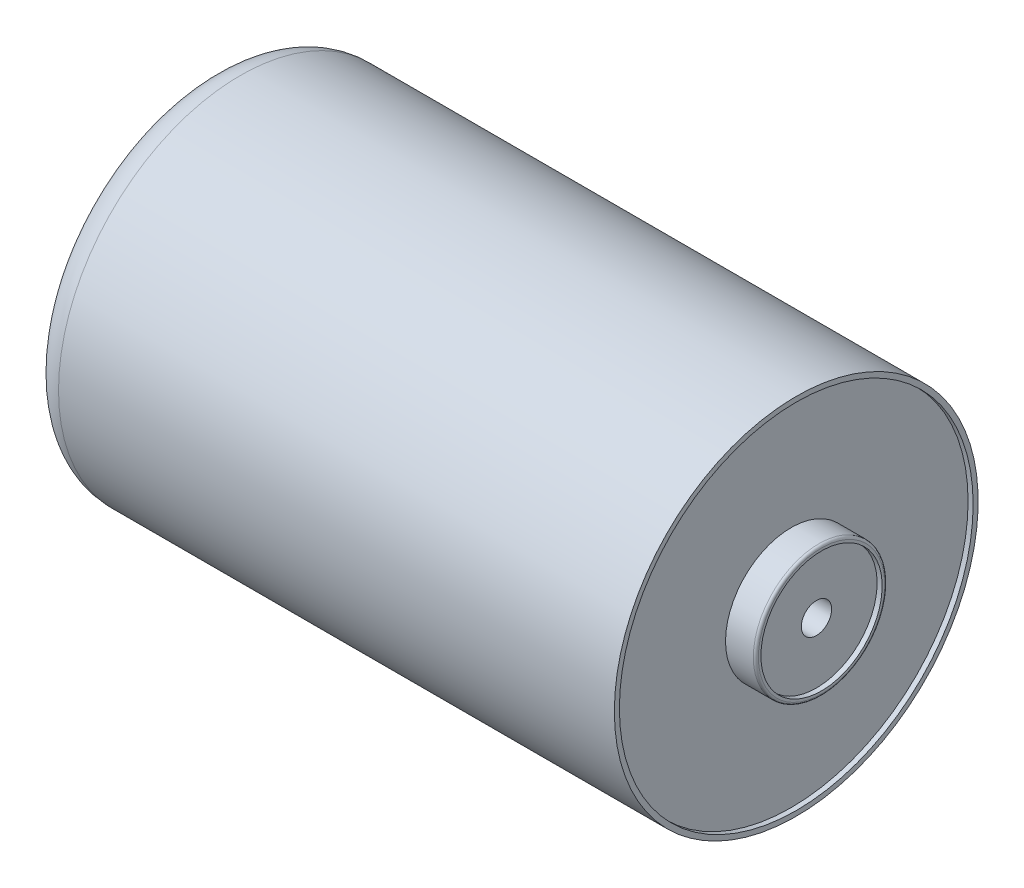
ISO-10303-21;
HEADER;
FILE_DESCRIPTION(('STEP AP214'),'2;1');
FILE_NAME('part.step','',(''),(''),'','','');
FILE_SCHEMA(('AUTOMOTIVE_DESIGN { 1 0 10303 214 1 1 1 1 }'));
ENDSEC;
DATA;
#1=APPLICATION_CONTEXT('core data for automotive mechanical design processes');
#2=APPLICATION_PROTOCOL_DEFINITION('international standard','automotive_design',2000,#1);
#3=PRODUCT_CONTEXT('',#1,'mechanical');
#4=PRODUCT('Part','Part','',(#3));
#5=PRODUCT_RELATED_PRODUCT_CATEGORY('part','',(#4));
#6=PRODUCT_DEFINITION_FORMATION('','',#4);
#7=PRODUCT_DEFINITION_CONTEXT('part definition',#1,'design');
#8=PRODUCT_DEFINITION('design','',#6,#7);
#9=PRODUCT_DEFINITION_SHAPE('','',#8);
#10=(LENGTH_UNIT() NAMED_UNIT(*) SI_UNIT(.MILLI.,.METRE.));
#11=(NAMED_UNIT(*) PLANE_ANGLE_UNIT() SI_UNIT($,.RADIAN.));
#12=(NAMED_UNIT(*) SI_UNIT($,.STERADIAN.) SOLID_ANGLE_UNIT());
#13=UNCERTAINTY_MEASURE_WITH_UNIT(LENGTH_MEASURE(1.E-05),#10,'distance_accuracy_value','');
#14=(GEOMETRIC_REPRESENTATION_CONTEXT(3) GLOBAL_UNCERTAINTY_ASSIGNED_CONTEXT((#13)) GLOBAL_UNIT_ASSIGNED_CONTEXT((#10,
#11,#12)) REPRESENTATION_CONTEXT('',''));
#15=CARTESIAN_POINT('',(0.,0.,0.));
#16=DIRECTION('',(0.,0.,1.));
#17=DIRECTION('',(1.,0.,0.));
#18=AXIS2_PLACEMENT_3D('',#15,#16,#17);
#19=CARTESIAN_POINT('',(0.,0.,0.));
#20=DIRECTION('',(-1.,0.,0.));
#21=DIRECTION('',(0.,0.,1.));
#22=AXIS2_PLACEMENT_3D('',#19,#20,#21);
#23=CYLINDRICAL_SURFACE('',#22,1.49999999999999);
#24=CARTESIAN_POINT('',(70.4735008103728,0.,0.));
#25=DIRECTION('',(-1.,0.,0.));
#26=DIRECTION('',(0.,0.,1.));
#27=AXIS2_PLACEMENT_3D('',#24,#25,#26);
#28=CIRCLE('',#27,1.5);
#29=CARTESIAN_POINT('',(70.4735008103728,0.,1.5));
#30=VERTEX_POINT('',#29);
#31=EDGE_CURVE('E91',#30,#30,#28,.T.);
#32=ORIENTED_EDGE('',*,*,#31,.F.);
#33=EDGE_LOOP('',(#32));
#34=FACE_BOUND('',#33,.T.);
#35=CARTESIAN_POINT('',(6.47350081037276,0.,0.));
#36=DIRECTION('',(-1.,0.,0.));
#37=DIRECTION('',(0.,0.,1.));
#38=AXIS2_PLACEMENT_3D('',#35,#36,#37);
#39=CIRCLE('',#38,1.49999999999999);
#40=CARTESIAN_POINT('',(6.47350081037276,0.,1.49999999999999));
#41=VERTEX_POINT('',#40);
#42=EDGE_CURVE('E64',#41,#41,#39,.T.);
#43=ORIENTED_EDGE('',*,*,#42,.T.);
#44=EDGE_LOOP('',(#43));
#45=FACE_BOUND('',#44,.T.);
#46=ADVANCED_FACE('F33',(#34,#45),#23,.F.);
#47=CARTESIAN_POINT('',(6.47350081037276,1.49999999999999,0.));
#48=DIRECTION('',(1.,0.,0.));
#49=DIRECTION('',(0.,0.,-1.));
#50=AXIS2_PLACEMENT_3D('',#47,#48,#49);
#51=PLANE('',#50);
#52=ORIENTED_EDGE('',*,*,#42,.F.);
#53=EDGE_LOOP('',(#52));
#54=FACE_BOUND('',#53,.T.);
#55=CARTESIAN_POINT('',(6.47350081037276,0.,0.));
#56=DIRECTION('',(-1.,0.,0.));
#57=DIRECTION('',(0.,0.,1.));
#58=AXIS2_PLACEMENT_3D('',#55,#56,#57);
#59=CIRCLE('',#58,6.);
#60=CARTESIAN_POINT('',(6.47350081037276,0.,6.));
#61=VERTEX_POINT('',#60);
#62=EDGE_CURVE('E67',#61,#61,#59,.T.);
#63=ORIENTED_EDGE('',*,*,#62,.T.);
#64=EDGE_LOOP('',(#63));
#65=FACE_BOUND('',#64,.T.);
#66=ADVANCED_FACE('F146',(#54,#65),#51,.F.);
#67=CARTESIAN_POINT('',(0.,0.,0.));
#68=DIRECTION('',(-1.,0.,0.));
#69=DIRECTION('',(0.,0.,1.));
#70=AXIS2_PLACEMENT_3D('',#67,#68,#69);
#71=CYLINDRICAL_SURFACE('',#70,6.);
#72=ORIENTED_EDGE('',*,*,#62,.F.);
#73=EDGE_LOOP('',(#72));
#74=FACE_BOUND('',#73,.T.);
#75=CARTESIAN_POINT('',(5.97350081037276,0.,0.));
#76=DIRECTION('',(-1.,0.,0.));
#77=DIRECTION('',(0.,0.,1.));
#78=AXIS2_PLACEMENT_3D('',#75,#76,#77);
#79=CIRCLE('',#78,6.);
#80=CARTESIAN_POINT('',(5.97350081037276,0.,6.));
#81=VERTEX_POINT('',#80);
#82=EDGE_CURVE('E70',#81,#81,#79,.T.);
#83=ORIENTED_EDGE('',*,*,#82,.T.);
#84=EDGE_LOOP('',(#83));
#85=FACE_BOUND('',#84,.T.);
#86=ADVANCED_FACE('F141',(#74,#85),#71,.F.);
#87=CARTESIAN_POINT('',(5.97350081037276,6.,0.));
#88=DIRECTION('',(1.,0.,0.));
#89=DIRECTION('',(0.,0.,-1.));
#90=AXIS2_PLACEMENT_3D('',#87,#88,#89);
#91=PLANE('',#90);
#92=CARTESIAN_POINT('',(5.97350081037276,0.,0.));
#93=DIRECTION('',(1.,0.,0.));
#94=DIRECTION('',(0.,0.,-1.));
#95=AXIS2_PLACEMENT_3D('',#92,#93,#94);
#96=CIRCLE('',#95,6.25);
#97=CARTESIAN_POINT('',(5.97350081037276,0.,-6.25));
#98=VERTEX_POINT('',#97);
#99=EDGE_CURVE('E43',#98,#98,#96,.F.);
#100=ORIENTED_EDGE('',*,*,#99,.T.);
#101=EDGE_LOOP('',(#100));
#102=FACE_BOUND('',#101,.T.);
#103=ORIENTED_EDGE('',*,*,#82,.F.);
#104=EDGE_LOOP('',(#103));
#105=FACE_BOUND('',#104,.T.);
#106=ADVANCED_FACE('F129',(#102,#105),#91,.F.);
#107=CARTESIAN_POINT('',(0.,0.,0.));
#108=DIRECTION('',(-1.,0.,0.));
#109=DIRECTION('',(0.,0.,1.));
#110=AXIS2_PLACEMENT_3D('',#107,#108,#109);
#111=CYLINDRICAL_SURFACE('',#110,6.5);
#112=CARTESIAN_POINT('',(10.2235008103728,0.,0.));
#113=DIRECTION('',(1.,0.,0.));
#114=DIRECTION('',(0.,0.,-1.));
#115=AXIS2_PLACEMENT_3D('',#112,#113,#114);
#116=CIRCLE('',#115,6.5);
#117=CARTESIAN_POINT('',(10.2235008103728,0.,-6.5));
#118=VERTEX_POINT('',#117);
#119=EDGE_CURVE('E52',#118,#118,#116,.F.);
#120=ORIENTED_EDGE('',*,*,#119,.T.);
#121=EDGE_LOOP('',(#120));
#122=FACE_BOUND('',#121,.T.);
#123=CARTESIAN_POINT('',(6.22350081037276,0.,0.));
#124=DIRECTION('',(1.,0.,0.));
#125=DIRECTION('',(0.,0.,-1.));
#126=AXIS2_PLACEMENT_3D('',#123,#124,#125);
#127=CIRCLE('',#126,6.5);
#128=CARTESIAN_POINT('',(6.22350081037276,0.,-6.5));
#129=VERTEX_POINT('',#128);
#130=EDGE_CURVE('E55',#129,#129,#127,.T.);
#131=ORIENTED_EDGE('',*,*,#130,.T.);
#132=EDGE_LOOP('',(#131));
#133=FACE_BOUND('',#132,.T.);
#134=ADVANCED_FACE('F113',(#122,#133),#111,.T.);
#135=CARTESIAN_POINT('',(10.4735008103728,6.5,0.));
#136=DIRECTION('',(1.,0.,0.));
#137=DIRECTION('',(0.,0.,-1.));
#138=AXIS2_PLACEMENT_3D('',#135,#136,#137);
#139=PLANE('',#138);
#140=CARTESIAN_POINT('',(10.4735008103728,0.,-12.5));
#141=DIRECTION('',(-1.,0.,0.));
#142=DIRECTION('',(0.,0.,-1.));
#143=AXIS2_PLACEMENT_3D('',#140,#141,#142);
#144=CIRCLE('',#143,1.);
#145=CARTESIAN_POINT('',(10.4735008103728,0.,-13.5));
#146=VERTEX_POINT('',#145);
#147=EDGE_CURVE('E103',#146,#146,#144,.T.);
#148=ORIENTED_EDGE('',*,*,#147,.F.);
#149=EDGE_LOOP('',(#148));
#150=FACE_BOUND('',#149,.T.);
#151=CARTESIAN_POINT('',(10.4735008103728,0.,12.5));
#152=DIRECTION('',(-1.,0.,0.));
#153=DIRECTION('',(0.,0.,1.));
#154=AXIS2_PLACEMENT_3D('',#151,#152,#153);
#155=CIRCLE('',#154,1.);
#156=CARTESIAN_POINT('',(10.4735008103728,0.,13.5));
#157=VERTEX_POINT('',#156);
#158=EDGE_CURVE('E97',#157,#157,#155,.T.);
#159=ORIENTED_EDGE('',*,*,#158,.F.);
#160=EDGE_LOOP('',(#159));
#161=FACE_BOUND('',#160,.T.);
#162=CARTESIAN_POINT('',(10.4735008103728,0.,0.));
#163=DIRECTION('',(1.,0.,0.));
#164=DIRECTION('',(0.,0.,-1.));
#165=AXIS2_PLACEMENT_3D('',#162,#163,#164);
#166=CIRCLE('',#165,15.);
#167=CARTESIAN_POINT('',(10.4735008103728,0.,-15.));
#168=VERTEX_POINT('',#167);
#169=EDGE_CURVE('E39',#168,#168,#166,.F.);
#170=ORIENTED_EDGE('',*,*,#169,.T.);
#171=EDGE_LOOP('',(#170));
#172=FACE_BOUND('',#171,.T.);
#173=CARTESIAN_POINT('',(10.4735008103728,0.,0.));
#174=DIRECTION('',(1.,0.,0.));
#175=DIRECTION('',(0.,0.,-1.));
#176=AXIS2_PLACEMENT_3D('',#173,#174,#175);
#177=CIRCLE('',#176,6.75);
#178=CARTESIAN_POINT('',(10.4735008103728,0.,-6.75));
#179=VERTEX_POINT('',#178);
#180=EDGE_CURVE('E47',#179,#179,#177,.T.);
#181=ORIENTED_EDGE('',*,*,#180,.T.);
#182=EDGE_LOOP('',(#181));
#183=FACE_BOUND('',#182,.T.);
#184=ADVANCED_FACE('F109',(#150,#161,#172,#183),#139,.F.);
#185=CARTESIAN_POINT('',(0.,0.,0.));
#186=DIRECTION('',(-1.,0.,0.));
#187=DIRECTION('',(0.,0.,1.));
#188=AXIS2_PLACEMENT_3D('',#185,#186,#187);
#189=CYLINDRICAL_SURFACE('',#188,18.);
#190=CARTESIAN_POINT('',(13.4735008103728,0.,0.));
#191=DIRECTION('',(1.,0.,0.));
#192=DIRECTION('',(0.,0.,-1.));
#193=AXIS2_PLACEMENT_3D('',#190,#191,#192);
#194=CIRCLE('',#193,18.);
#195=CARTESIAN_POINT('',(13.4735008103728,0.,-18.));
#196=VERTEX_POINT('',#195);
#197=EDGE_CURVE('E10',#196,#196,#194,.T.);
#198=ORIENTED_EDGE('',*,*,#197,.T.);
#199=EDGE_LOOP('',(#198));
#200=FACE_BOUND('',#199,.T.);
#201=CARTESIAN_POINT('',(68.4735008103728,0.,0.));
#202=DIRECTION('',(-1.,0.,0.));
#203=DIRECTION('',(0.,0.,1.));
#204=AXIS2_PLACEMENT_3D('',#201,#202,#203);
#205=CIRCLE('',#204,18.);
#206=CARTESIAN_POINT('',(68.4735008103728,0.,18.));
#207=VERTEX_POINT('',#206);
#208=EDGE_CURVE('E73',#207,#207,#205,.T.);
#209=ORIENTED_EDGE('',*,*,#208,.T.);
#210=EDGE_LOOP('',(#209));
#211=FACE_BOUND('',#210,.T.);
#212=ADVANCED_FACE('F112',(#200,#211),#189,.T.);
#213=CARTESIAN_POINT('',(68.4735008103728,18.,0.));
#214=DIRECTION('',(-1.,0.,0.));
#215=DIRECTION('',(0.,0.,1.));
#216=AXIS2_PLACEMENT_3D('',#213,#214,#215);
#217=PLANE('',#216);
#218=ORIENTED_EDGE('',*,*,#208,.F.);
#219=EDGE_LOOP('',(#218));
#220=FACE_BOUND('',#219,.T.);
#221=CARTESIAN_POINT('',(68.4735008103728,0.,0.));
#222=DIRECTION('',(-1.,0.,0.));
#223=DIRECTION('',(0.,0.,1.));
#224=AXIS2_PLACEMENT_3D('',#221,#222,#223);
#225=CIRCLE('',#224,17.5029717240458);
#226=CARTESIAN_POINT('',(68.4735008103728,0.,17.5029717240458));
#227=VERTEX_POINT('',#226);
#228=EDGE_CURVE('E76',#227,#227,#225,.T.);
#229=ORIENTED_EDGE('',*,*,#228,.T.);
#230=EDGE_LOOP('',(#229));
#231=FACE_BOUND('',#230,.T.);
#232=ADVANCED_FACE('F193',(#220,#231),#217,.F.);
#233=CARTESIAN_POINT('',(0.,0.,0.));
#234=DIRECTION('',(-1.,0.,0.));
#235=DIRECTION('',(0.,0.,1.));
#236=AXIS2_PLACEMENT_3D('',#233,#234,#235);
#237=CYLINDRICAL_SURFACE('',#236,17.5029717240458);
#238=ORIENTED_EDGE('',*,*,#228,.F.);
#239=EDGE_LOOP('',(#238));
#240=FACE_BOUND('',#239,.T.);
#241=CARTESIAN_POINT('',(67.9735008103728,0.,0.));
#242=DIRECTION('',(-1.,0.,0.));
#243=DIRECTION('',(0.,0.,1.));
#244=AXIS2_PLACEMENT_3D('',#241,#242,#243);
#245=CIRCLE('',#244,17.5029717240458);
#246=CARTESIAN_POINT('',(67.9735008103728,0.,17.5029717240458));
#247=VERTEX_POINT('',#246);
#248=EDGE_CURVE('E79',#247,#247,#245,.T.);
#249=ORIENTED_EDGE('',*,*,#248,.T.);
#250=EDGE_LOOP('',(#249));
#251=FACE_BOUND('',#250,.T.);
#252=ADVANCED_FACE('F189',(#240,#251),#237,.F.);
#253=CARTESIAN_POINT('',(67.9735008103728,17.5029717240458,0.));
#254=DIRECTION('',(-1.,0.,0.));
#255=DIRECTION('',(0.,0.,1.));
#256=AXIS2_PLACEMENT_3D('',#253,#254,#255);
#257=PLANE('',#256);
#258=ORIENTED_EDGE('',*,*,#248,.F.);
#259=EDGE_LOOP('',(#258));
#260=FACE_BOUND('',#259,.T.);
#261=CARTESIAN_POINT('',(67.9735008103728,0.,0.));
#262=DIRECTION('',(-1.,0.,0.));
#263=DIRECTION('',(0.,0.,1.));
#264=AXIS2_PLACEMENT_3D('',#261,#262,#263);
#265=CIRCLE('',#264,6.5);
#266=CARTESIAN_POINT('',(67.9735008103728,0.,6.5));
#267=VERTEX_POINT('',#266);
#268=EDGE_CURVE('E82',#267,#267,#265,.T.);
#269=ORIENTED_EDGE('',*,*,#268,.T.);
#270=EDGE_LOOP('',(#269));
#271=FACE_BOUND('',#270,.T.);
#272=ADVANCED_FACE('F185',(#260,#271),#257,.F.);
#273=CARTESIAN_POINT('',(0.,0.,0.));
#274=DIRECTION('',(-1.,0.,0.));
#275=DIRECTION('',(0.,0.,1.));
#276=AXIS2_PLACEMENT_3D('',#273,#274,#275);
#277=CYLINDRICAL_SURFACE('',#276,6.5);
#278=CARTESIAN_POINT('',(70.7235008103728,0.,0.));
#279=DIRECTION('',(-1.,0.,0.));
#280=DIRECTION('',(0.,0.,1.));
#281=AXIS2_PLACEMENT_3D('',#278,#279,#280);
#282=CIRCLE('',#281,6.5);
#283=CARTESIAN_POINT('',(70.7235008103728,0.,6.5));
#284=VERTEX_POINT('',#283);
#285=EDGE_CURVE('E61',#284,#284,#282,.T.);
#286=ORIENTED_EDGE('',*,*,#285,.T.);
#287=EDGE_LOOP('',(#286));
#288=FACE_BOUND('',#287,.T.);
#289=ORIENTED_EDGE('',*,*,#268,.F.);
#290=EDGE_LOOP('',(#289));
#291=FACE_BOUND('',#290,.T.);
#292=ADVANCED_FACE('F181',(#288,#291),#277,.T.);
#293=CARTESIAN_POINT('',(70.9735008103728,6.5,0.));
#294=DIRECTION('',(-1.,0.,0.));
#295=DIRECTION('',(0.,0.,1.));
#296=AXIS2_PLACEMENT_3D('',#293,#294,#295);
#297=PLANE('',#296);
#298=CARTESIAN_POINT('',(70.9735008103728,0.,0.));
#299=DIRECTION('',(-1.,0.,0.));
#300=DIRECTION('',(0.,0.,1.));
#301=AXIS2_PLACEMENT_3D('',#298,#299,#300);
#302=CIRCLE('',#301,6.25);
#303=CARTESIAN_POINT('',(70.9735008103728,0.,6.25));
#304=VERTEX_POINT('',#303);
#305=EDGE_CURVE('E58',#304,#304,#302,.F.);
#306=ORIENTED_EDGE('',*,*,#305,.T.);
#307=EDGE_LOOP('',(#306));
#308=FACE_BOUND('',#307,.T.);
#309=CARTESIAN_POINT('',(70.9735008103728,0.,0.));
#310=DIRECTION('',(-1.,0.,0.));
#311=DIRECTION('',(0.,0.,1.));
#312=AXIS2_PLACEMENT_3D('',#309,#310,#311);
#313=CIRCLE('',#312,6.);
#314=CARTESIAN_POINT('',(70.9735008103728,0.,6.));
#315=VERTEX_POINT('',#314);
#316=EDGE_CURVE('E85',#315,#315,#313,.T.);
#317=ORIENTED_EDGE('',*,*,#316,.T.);
#318=EDGE_LOOP('',(#317));
#319=FACE_BOUND('',#318,.T.);
#320=ADVANCED_FACE('F174',(#308,#319),#297,.F.);
#321=CARTESIAN_POINT('',(0.,0.,0.));
#322=DIRECTION('',(-1.,0.,0.));
#323=DIRECTION('',(0.,0.,1.));
#324=AXIS2_PLACEMENT_3D('',#321,#322,#323);
#325=CYLINDRICAL_SURFACE('',#324,6.);
#326=ORIENTED_EDGE('',*,*,#316,.F.);
#327=EDGE_LOOP('',(#326));
#328=FACE_BOUND('',#327,.T.);
#329=CARTESIAN_POINT('',(70.4735008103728,0.,0.));
#330=DIRECTION('',(-1.,0.,0.));
#331=DIRECTION('',(0.,0.,1.));
#332=AXIS2_PLACEMENT_3D('',#329,#330,#331);
#333=CIRCLE('',#332,6.);
#334=CARTESIAN_POINT('',(70.4735008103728,0.,6.));
#335=VERTEX_POINT('',#334);
#336=EDGE_CURVE('E88',#335,#335,#333,.T.);
#337=ORIENTED_EDGE('',*,*,#336,.T.);
#338=EDGE_LOOP('',(#337));
#339=FACE_BOUND('',#338,.T.);
#340=ADVANCED_FACE('F165',(#328,#339),#325,.F.);
#341=CARTESIAN_POINT('',(70.4735008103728,6.,0.));
#342=DIRECTION('',(-1.,0.,0.));
#343=DIRECTION('',(0.,0.,1.));
#344=AXIS2_PLACEMENT_3D('',#341,#342,#343);
#345=PLANE('',#344);
#346=ORIENTED_EDGE('',*,*,#336,.F.);
#347=EDGE_LOOP('',(#346));
#348=FACE_BOUND('',#347,.T.);
#349=ORIENTED_EDGE('',*,*,#31,.T.);
#350=EDGE_LOOP('',(#349));
#351=FACE_BOUND('',#350,.T.);
#352=ADVANCED_FACE('F163',(#348,#351),#345,.F.);
#353=CARTESIAN_POINT('',(70.7235008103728,0.,0.));
#354=DIRECTION('',(-1.,0.,0.));
#355=DIRECTION('',(0.,0.,1.));
#356=AXIS2_PLACEMENT_3D('',#353,#354,#355);
#357=TOROIDAL_SURFACE('',#356,6.25,0.25);
#358=ORIENTED_EDGE('',*,*,#305,.F.);
#359=EDGE_LOOP('',(#358));
#360=FACE_BOUND('',#359,.T.);
#361=ORIENTED_EDGE('',*,*,#285,.F.);
#362=EDGE_LOOP('',(#361));
#363=FACE_BOUND('',#362,.T.);
#364=ADVANCED_FACE('F123',(#360,#363),#357,.T.);
#365=CARTESIAN_POINT('',(10.2235008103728,0.,0.));
#366=DIRECTION('',(1.,0.,0.));
#367=DIRECTION('',(0.,0.,-1.));
#368=AXIS2_PLACEMENT_3D('',#365,#366,#367);
#369=TOROIDAL_SURFACE('',#368,6.75,0.25);
#370=ORIENTED_EDGE('',*,*,#180,.F.);
#371=EDGE_LOOP('',(#370));
#372=FACE_BOUND('',#371,.T.);
#373=ORIENTED_EDGE('',*,*,#119,.F.);
#374=EDGE_LOOP('',(#373));
#375=FACE_BOUND('',#374,.T.);
#376=ADVANCED_FACE('F119',(#372,#375),#369,.F.);
#377=CARTESIAN_POINT('',(6.22350081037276,0.,0.));
#378=DIRECTION('',(1.,0.,0.));
#379=DIRECTION('',(0.,0.,-1.));
#380=AXIS2_PLACEMENT_3D('',#377,#378,#379);
#381=TOROIDAL_SURFACE('',#380,6.25,0.25);
#382=ORIENTED_EDGE('',*,*,#130,.F.);
#383=EDGE_LOOP('',(#382));
#384=FACE_BOUND('',#383,.T.);
#385=ORIENTED_EDGE('',*,*,#99,.F.);
#386=EDGE_LOOP('',(#385));
#387=FACE_BOUND('',#386,.T.);
#388=ADVANCED_FACE('F122',(#384,#387),#381,.T.);
#389=CARTESIAN_POINT('',(13.4735008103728,0.,0.));
#390=DIRECTION('',(1.,0.,0.));
#391=DIRECTION('',(0.,0.,-1.));
#392=AXIS2_PLACEMENT_3D('',#389,#390,#391);
#393=TOROIDAL_SURFACE('',#392,15.,3.);
#394=ORIENTED_EDGE('',*,*,#197,.F.);
#395=EDGE_LOOP('',(#394));
#396=FACE_BOUND('',#395,.T.);
#397=ORIENTED_EDGE('',*,*,#169,.F.);
#398=EDGE_LOOP('',(#397));
#399=FACE_BOUND('',#398,.T.);
#400=ADVANCED_FACE('F135',(#396,#399),#393,.T.);
#401=CARTESIAN_POINT('',(20.4735008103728,0.,12.5));
#402=DIRECTION('',(-1.,0.,0.));
#403=DIRECTION('',(0.,0.,1.));
#404=AXIS2_PLACEMENT_3D('',#401,#402,#403);
#405=CYLINDRICAL_SURFACE('',#404,1.);
#406=CARTESIAN_POINT('',(20.4735008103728,0.,12.5));
#407=DIRECTION('',(-1.,0.,0.));
#408=DIRECTION('',(0.,0.,1.));
#409=AXIS2_PLACEMENT_3D('',#406,#407,#408);
#410=CIRCLE('',#409,1.);
#411=CARTESIAN_POINT('',(20.4735008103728,0.,13.5));
#412=VERTEX_POINT('',#411);
#413=EDGE_CURVE('E94',#412,#412,#410,.T.);
#414=ORIENTED_EDGE('',*,*,#413,.F.);
#415=EDGE_LOOP('',(#414));
#416=FACE_BOUND('',#415,.T.);
#417=ORIENTED_EDGE('',*,*,#158,.T.);
#418=EDGE_LOOP('',(#417));
#419=FACE_BOUND('',#418,.T.);
#420=ADVANCED_FACE('F265',(#416,#419),#405,.F.);
#421=CARTESIAN_POINT('',(20.4735008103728,0.,12.5));
#422=DIRECTION('',(-1.,0.,0.));
#423=DIRECTION('',(0.,0.,1.));
#424=AXIS2_PLACEMENT_3D('',#421,#422,#423);
#425=PLANE('',#424);
#426=ORIENTED_EDGE('',*,*,#413,.T.);
#427=EDGE_LOOP('',(#426));
#428=FACE_BOUND('',#427,.T.);
#429=ADVANCED_FACE('F273',(#428),#425,.T.);
#430=CARTESIAN_POINT('',(20.4735008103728,0.,-12.5));
#431=DIRECTION('',(-1.,0.,0.));
#432=DIRECTION('',(0.,0.,1.));
#433=AXIS2_PLACEMENT_3D('',#430,#431,#432);
#434=CYLINDRICAL_SURFACE('',#433,1.);
#435=CARTESIAN_POINT('',(20.4735008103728,0.,-12.5));
#436=DIRECTION('',(-1.,0.,0.));
#437=DIRECTION('',(0.,0.,-1.));
#438=AXIS2_PLACEMENT_3D('',#435,#436,#437);
#439=CIRCLE('',#438,1.);
#440=CARTESIAN_POINT('',(20.4735008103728,0.,-13.5));
#441=VERTEX_POINT('',#440);
#442=EDGE_CURVE('E100',#441,#441,#439,.T.);
#443=ORIENTED_EDGE('',*,*,#442,.F.);
#444=EDGE_LOOP('',(#443));
#445=FACE_BOUND('',#444,.T.);
#446=ORIENTED_EDGE('',*,*,#147,.T.);
#447=EDGE_LOOP('',(#446));
#448=FACE_BOUND('',#447,.T.);
#449=ADVANCED_FACE('F107',(#445,#448),#434,.F.);
#450=CARTESIAN_POINT('',(20.4735008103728,0.,-12.5));
#451=DIRECTION('',(1.,0.,0.));
#452=DIRECTION('',(0.,0.,-1.));
#453=AXIS2_PLACEMENT_3D('',#450,#451,#452);
#454=PLANE('',#453);
#455=ORIENTED_EDGE('',*,*,#442,.T.);
#456=EDGE_LOOP('',(#455));
#457=FACE_BOUND('',#456,.T.);
#458=ADVANCED_FACE('F288',(#457),#454,.F.);
#459=CLOSED_SHELL('',(#46,#66,#86,#106,#134,#184,#212,#232,#252,#272,#292,#320,#340,#352,#364,
#376,#388,#400,#420,#429,#449,#458));
#460=MANIFOLD_SOLID_BREP('B2',#459);
#461=ADVANCED_BREP_SHAPE_REPRESENTATION('',(#18,#460),#14);
#462=SHAPE_DEFINITION_REPRESENTATION(#9,#461);
ENDSEC;
END-ISO-10303-21;
